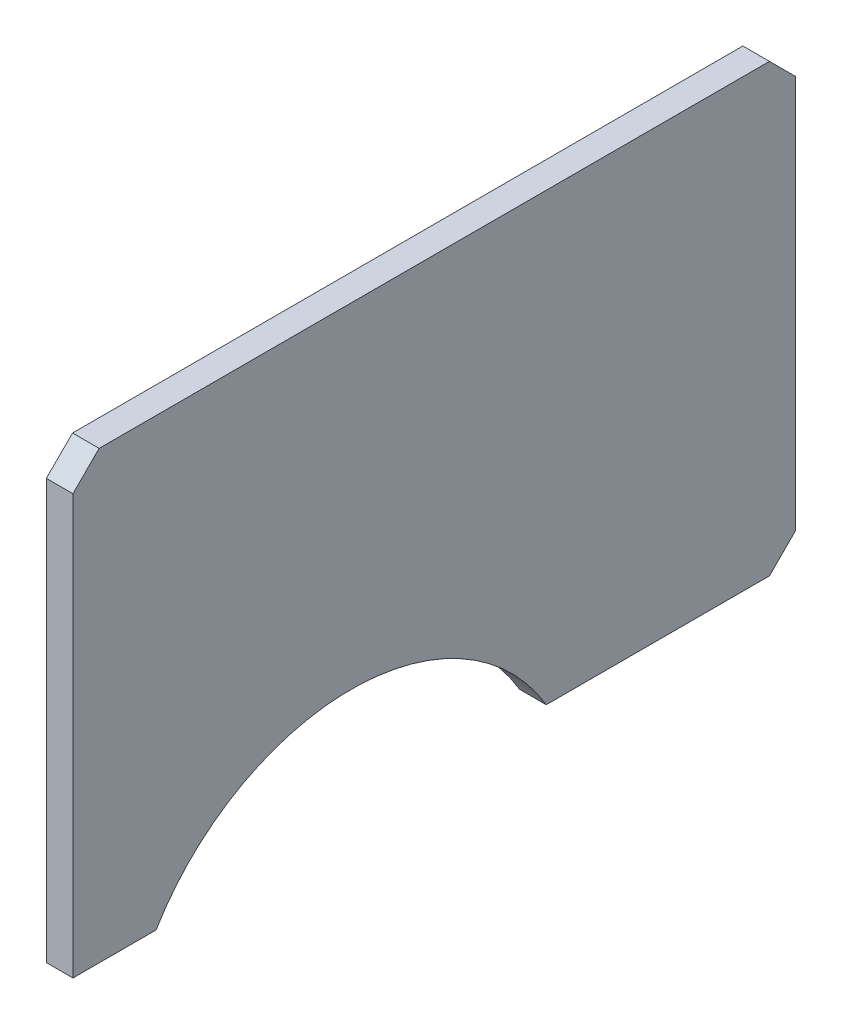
ISO-10303-21;
HEADER;
FILE_DESCRIPTION(('STEP AP214'),'2;1');
FILE_NAME('part.step','',(''),(''),'','','');
FILE_SCHEMA(('AUTOMOTIVE_DESIGN { 1 0 10303 214 1 1 1 1 }'));
ENDSEC;
DATA;
#1=APPLICATION_CONTEXT('core data for automotive mechanical design processes');
#2=APPLICATION_PROTOCOL_DEFINITION('international standard','automotive_design',2000,#1);
#3=PRODUCT_CONTEXT('',#1,'mechanical');
#4=PRODUCT('Part','Part','',(#3));
#5=PRODUCT_RELATED_PRODUCT_CATEGORY('part','',(#4));
#6=PRODUCT_DEFINITION_FORMATION('','',#4);
#7=PRODUCT_DEFINITION_CONTEXT('part definition',#1,'design');
#8=PRODUCT_DEFINITION('design','',#6,#7);
#9=PRODUCT_DEFINITION_SHAPE('','',#8);
#10=(LENGTH_UNIT() NAMED_UNIT(*) SI_UNIT(.MILLI.,.METRE.));
#11=(NAMED_UNIT(*) PLANE_ANGLE_UNIT() SI_UNIT($,.RADIAN.));
#12=(NAMED_UNIT(*) SI_UNIT($,.STERADIAN.) SOLID_ANGLE_UNIT());
#13=UNCERTAINTY_MEASURE_WITH_UNIT(LENGTH_MEASURE(1.E-05),#10,'distance_accuracy_value','');
#14=(GEOMETRIC_REPRESENTATION_CONTEXT(3) GLOBAL_UNCERTAINTY_ASSIGNED_CONTEXT((#13)) GLOBAL_UNIT_ASSIGNED_CONTEXT((#10,
#11,#12)) REPRESENTATION_CONTEXT('',''));
#15=CARTESIAN_POINT('',(0.,0.,0.));
#16=DIRECTION('',(0.,0.,1.));
#17=DIRECTION('',(1.,0.,0.));
#18=AXIS2_PLACEMENT_3D('',#15,#16,#17);
#19=CARTESIAN_POINT('',(384.979205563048,181.6432469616,-296.936999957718));
#20=DIRECTION('',(0.,-1.,0.));
#21=DIRECTION('',(0.,0.,-1.));
#22=AXIS2_PLACEMENT_3D('',#19,#20,#21);
#23=PLANE('',#22);
#24=DIRECTION('',(1.,0.,0.));
#25=VECTOR('',#24,1.);
#26=CARTESIAN_POINT('',(384.979205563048,181.6432469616,-269.361999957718));
#27=LINE('',#26,#25);
#28=CARTESIAN_POINT('',(384.979205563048,181.6432469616,-269.361999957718));
#29=VERTEX_POINT('',#28);
#30=CARTESIAN_POINT('',(388.027205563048,181.6432469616,-269.361999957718));
#31=VERTEX_POINT('',#30);
#32=EDGE_CURVE('E50',#29,#31,#27,.T.);
#33=ORIENTED_EDGE('',*,*,#32,.F.);
#34=DIRECTION('',(0.,0.,-1.));
#35=VECTOR('',#34,1.);
#36=CARTESIAN_POINT('',(384.979205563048,181.6432469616,-296.936999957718));
#37=LINE('',#36,#35);
#38=CARTESIAN_POINT('',(384.979205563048,181.6432469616,-294.936999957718));
#39=VERTEX_POINT('',#38);
#40=EDGE_CURVE('E120',#29,#39,#37,.T.);
#41=ORIENTED_EDGE('',*,*,#40,.T.);
#42=DIRECTION('',(1.,0.,0.));
#43=VECTOR('',#42,1.);
#44=CARTESIAN_POINT('',(384.979205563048,181.6432469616,-294.936999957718));
#45=LINE('',#44,#43);
#46=CARTESIAN_POINT('',(388.027205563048,181.6432469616,-294.936999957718));
#47=VERTEX_POINT('',#46);
#48=EDGE_CURVE('E133',#39,#47,#45,.T.);
#49=ORIENTED_EDGE('',*,*,#48,.T.);
#50=DIRECTION('',(0.,0.,-1.));
#51=VECTOR('',#50,1.);
#52=CARTESIAN_POINT('',(388.027205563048,181.6432469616,-296.936999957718));
#53=LINE('',#52,#51);
#54=EDGE_CURVE('E136',#31,#47,#53,.T.);
#55=ORIENTED_EDGE('',*,*,#54,.F.);
#56=EDGE_LOOP('',(#33,#41,#49,#55));
#57=FACE_BOUND('',#56,.T.);
#58=ADVANCED_FACE('F35',(#57),#23,.T.);
#59=DIRECTION('',(1.,0.,0.));
#60=VECTOR('',#59,1.);
#61=CARTESIAN_POINT('',(384.979205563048,181.6432469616,-224.657999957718));
#62=LINE('',#61,#60);
#63=CARTESIAN_POINT('',(384.979205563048,181.6432469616,-224.657999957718));
#64=VERTEX_POINT('',#63);
#65=CARTESIAN_POINT('',(388.027205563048,181.6432469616,-224.657999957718));
#66=VERTEX_POINT('',#65);
#67=EDGE_CURVE('E104',#64,#66,#62,.T.);
#68=ORIENTED_EDGE('',*,*,#67,.T.);
#69=CARTESIAN_POINT('',(388.027205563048,181.6432469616,-215.132999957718));
#70=VERTEX_POINT('',#69);
#71=EDGE_CURVE('E137',#70,#66,#53,.T.);
#72=ORIENTED_EDGE('',*,*,#71,.F.);
#73=DIRECTION('',(1.,0.,0.));
#74=VECTOR('',#73,1.);
#75=CARTESIAN_POINT('',(384.979205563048,181.6432469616,-215.132999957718));
#76=LINE('',#75,#74);
#77=CARTESIAN_POINT('',(384.979205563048,181.6432469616,-215.132999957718));
#78=VERTEX_POINT('',#77);
#79=EDGE_CURVE('E11',#78,#70,#76,.T.);
#80=ORIENTED_EDGE('',*,*,#79,.F.);
#81=EDGE_CURVE('E43',#78,#64,#37,.T.);
#82=ORIENTED_EDGE('',*,*,#81,.T.);
#83=EDGE_LOOP('',(#68,#72,#80,#82));
#84=FACE_BOUND('',#83,.T.);
#85=ADVANCED_FACE('F123',(#84),#23,.T.);
#86=CARTESIAN_POINT('',(384.979205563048,181.6432469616,-215.132999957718));
#87=DIRECTION('',(0.,0.,1.));
#88=DIRECTION('',(1.,0.,0.));
#89=AXIS2_PLACEMENT_3D('',#86,#87,#88);
#90=PLANE('',#89);
#91=DIRECTION('',(1.,0.,0.));
#92=VECTOR('',#91,1.);
#93=CARTESIAN_POINT('',(384.979205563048,229.6972469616,-215.132999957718));
#94=LINE('',#93,#92);
#95=CARTESIAN_POINT('',(384.979205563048,229.6972469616,-215.132999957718));
#96=VERTEX_POINT('',#95);
#97=CARTESIAN_POINT('',(388.027205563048,229.6972469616,-215.132999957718));
#98=VERTEX_POINT('',#97);
#99=EDGE_CURVE('E170',#96,#98,#94,.T.);
#100=ORIENTED_EDGE('',*,*,#99,.F.);
#101=DIRECTION('',(0.,-1.,0.));
#102=VECTOR('',#101,1.);
#103=CARTESIAN_POINT('',(384.979205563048,181.6432469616,-215.132999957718));
#104=LINE('',#103,#102);
#105=EDGE_CURVE('E125',#96,#78,#104,.T.);
#106=ORIENTED_EDGE('',*,*,#105,.T.);
#107=ORIENTED_EDGE('',*,*,#79,.T.);
#108=DIRECTION('',(0.,-1.,0.));
#109=VECTOR('',#108,1.);
#110=CARTESIAN_POINT('',(388.027205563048,181.6432469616,-215.132999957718));
#111=LINE('',#110,#109);
#112=EDGE_CURVE('E135',#98,#70,#111,.T.);
#113=ORIENTED_EDGE('',*,*,#112,.F.);
#114=EDGE_LOOP('',(#100,#106,#107,#113));
#115=FACE_BOUND('',#114,.T.);
#116=ADVANCED_FACE('F168',(#115),#90,.T.);
#117=CARTESIAN_POINT('',(384.979205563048,232.6972469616,-216.132999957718));
#118=DIRECTION('',(0.,1.,0.));
#119=DIRECTION('',(0.,0.,1.));
#120=AXIS2_PLACEMENT_3D('',#117,#118,#119);
#121=PLANE('',#120);
#122=DIRECTION('',(1.,0.,0.));
#123=VECTOR('',#122,1.);
#124=CARTESIAN_POINT('',(384.979205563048,232.6972469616,-294.936999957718));
#125=LINE('',#124,#123);
#126=CARTESIAN_POINT('',(384.979205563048,232.6972469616,-294.936999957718));
#127=VERTEX_POINT('',#126);
#128=CARTESIAN_POINT('',(388.027205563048,232.6972469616,-294.936999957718));
#129=VERTEX_POINT('',#128);
#130=EDGE_CURVE('E58',#127,#129,#125,.T.);
#131=ORIENTED_EDGE('',*,*,#130,.F.);
#132=DIRECTION('',(0.,0.,1.));
#133=VECTOR('',#132,1.);
#134=CARTESIAN_POINT('',(384.979205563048,232.6972469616,-216.132999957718));
#135=LINE('',#134,#133);
#136=CARTESIAN_POINT('',(384.979205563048,232.6972469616,-218.132999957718));
#137=VERTEX_POINT('',#136);
#138=EDGE_CURVE('E141',#127,#137,#135,.T.);
#139=ORIENTED_EDGE('',*,*,#138,.T.);
#140=DIRECTION('',(1.,0.,0.));
#141=VECTOR('',#140,1.);
#142=CARTESIAN_POINT('',(384.979205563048,232.6972469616,-218.132999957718));
#143=LINE('',#142,#141);
#144=CARTESIAN_POINT('',(388.027205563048,232.6972469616,-218.132999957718));
#145=VERTEX_POINT('',#144);
#146=EDGE_CURVE('E157',#137,#145,#143,.T.);
#147=ORIENTED_EDGE('',*,*,#146,.T.);
#148=DIRECTION('',(0.,0.,1.));
#149=VECTOR('',#148,1.);
#150=CARTESIAN_POINT('',(388.027205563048,232.6972469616,-216.132999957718));
#151=LINE('',#150,#149);
#152=EDGE_CURVE('E132',#129,#145,#151,.T.);
#153=ORIENTED_EDGE('',*,*,#152,.F.);
#154=EDGE_LOOP('',(#131,#139,#147,#153));
#155=FACE_BOUND('',#154,.T.);
#156=ADVANCED_FACE('F192',(#155),#121,.T.);
#157=CARTESIAN_POINT('',(384.979205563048,231.6972469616,-297.936999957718));
#158=DIRECTION('',(0.,0.,-1.));
#159=DIRECTION('',(-1.,0.,0.));
#160=AXIS2_PLACEMENT_3D('',#157,#158,#159);
#161=PLANE('',#160);
#162=DIRECTION('',(1.,0.,0.));
#163=VECTOR('',#162,1.);
#164=CARTESIAN_POINT('',(384.979205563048,229.6972469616,-297.936999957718));
#165=LINE('',#164,#163);
#166=CARTESIAN_POINT('',(384.979205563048,229.6972469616,-297.936999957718));
#167=VERTEX_POINT('',#166);
#168=CARTESIAN_POINT('',(388.027205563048,229.6972469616,-297.936999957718));
#169=VERTEX_POINT('',#168);
#170=EDGE_CURVE('E179',#167,#169,#165,.T.);
#171=ORIENTED_EDGE('',*,*,#170,.T.);
#172=DIRECTION('',(0.,1.,0.));
#173=VECTOR('',#172,1.);
#174=CARTESIAN_POINT('',(388.027205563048,231.6972469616,-297.936999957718));
#175=LINE('',#174,#173);
#176=CARTESIAN_POINT('',(388.027205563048,184.6432469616,-297.936999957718));
#177=VERTEX_POINT('',#176);
#178=EDGE_CURVE('E129',#177,#169,#175,.T.);
#179=ORIENTED_EDGE('',*,*,#178,.F.);
#180=DIRECTION('',(1.,0.,0.));
#181=VECTOR('',#180,1.);
#182=CARTESIAN_POINT('',(384.979205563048,184.6432469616,-297.936999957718));
#183=LINE('',#182,#181);
#184=CARTESIAN_POINT('',(384.979205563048,184.6432469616,-297.936999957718));
#185=VERTEX_POINT('',#184);
#186=EDGE_CURVE('E155',#185,#177,#183,.T.);
#187=ORIENTED_EDGE('',*,*,#186,.F.);
#188=DIRECTION('',(0.,1.,0.));
#189=VECTOR('',#188,1.);
#190=CARTESIAN_POINT('',(384.979205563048,231.6972469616,-297.936999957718));
#191=LINE('',#190,#189);
#192=EDGE_CURVE('E138',#185,#167,#191,.T.);
#193=ORIENTED_EDGE('',*,*,#192,.T.);
#194=EDGE_LOOP('',(#171,#179,#187,#193));
#195=FACE_BOUND('',#194,.T.);
#196=ADVANCED_FACE('F37',(#195),#161,.T.);
#197=CARTESIAN_POINT('',(384.979205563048,182.6432469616,-296.936999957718));
#198=DIRECTION('',(1.,0.,0.));
#199=DIRECTION('',(0.,0.,-1.));
#200=AXIS2_PLACEMENT_3D('',#197,#198,#199);
#201=PLANE('',#200);
#202=ORIENTED_EDGE('',*,*,#40,.F.);
#203=CARTESIAN_POINT('',(384.979205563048,168.3234869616,-247.009999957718));
#204=DIRECTION('',(1.,0.,0.));
#205=DIRECTION('',(0.,0.,1.));
#206=AXIS2_PLACEMENT_3D('',#203,#204,#205);
#207=CIRCLE('',#206,26.01976);
#208=EDGE_CURVE('E107',#29,#64,#207,.T.);
#209=ORIENTED_EDGE('',*,*,#208,.T.);
#210=ORIENTED_EDGE('',*,*,#81,.F.);
#211=ORIENTED_EDGE('',*,*,#105,.F.);
#212=DIRECTION('',(0.,0.707106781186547,-0.707106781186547));
#213=VECTOR('',#212,1.);
#214=CARTESIAN_POINT('',(384.979205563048,229.6972469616,-215.132999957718));
#215=LINE('',#214,#213);
#216=EDGE_CURVE('E172',#96,#137,#215,.T.);
#217=ORIENTED_EDGE('',*,*,#216,.T.);
#218=ORIENTED_EDGE('',*,*,#138,.F.);
#219=DIRECTION('',(0.,-0.707106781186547,-0.707106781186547));
#220=VECTOR('',#219,1.);
#221=CARTESIAN_POINT('',(384.979205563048,232.6972469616,-294.936999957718));
#222=LINE('',#221,#220);
#223=EDGE_CURVE('E190',#127,#167,#222,.T.);
#224=ORIENTED_EDGE('',*,*,#223,.T.);
#225=ORIENTED_EDGE('',*,*,#192,.F.);
#226=DIRECTION('',(0.,-0.707106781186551,0.707106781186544));
#227=VECTOR('',#226,1.);
#228=CARTESIAN_POINT('',(384.979205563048,181.6432469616,-294.936999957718));
#229=LINE('',#228,#227);
#230=EDGE_CURVE('E156',#185,#39,#229,.T.);
#231=ORIENTED_EDGE('',*,*,#230,.T.);
#232=EDGE_LOOP('',(#202,#209,#210,#211,#217,#218,#224,#225,#231));
#233=FACE_BOUND('',#232,.T.);
#234=ADVANCED_FACE('F117',(#233),#201,.F.);
#235=CARTESIAN_POINT('',(388.027205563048,182.6432469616,-296.936999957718));
#236=DIRECTION('',(1.,0.,0.));
#237=DIRECTION('',(0.,0.,-1.));
#238=AXIS2_PLACEMENT_3D('',#235,#236,#237);
#239=PLANE('',#238);
#240=CARTESIAN_POINT('',(388.027205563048,168.3234869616,-247.009999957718));
#241=DIRECTION('',(1.,0.,0.));
#242=DIRECTION('',(0.,0.,1.));
#243=AXIS2_PLACEMENT_3D('',#240,#241,#242);
#244=CIRCLE('',#243,26.01976);
#245=EDGE_CURVE('E108',#31,#66,#244,.T.);
#246=ORIENTED_EDGE('',*,*,#245,.F.);
#247=ORIENTED_EDGE('',*,*,#54,.T.);
#248=DIRECTION('',(0.,-0.707106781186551,0.707106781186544));
#249=VECTOR('',#248,1.);
#250=CARTESIAN_POINT('',(388.027205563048,181.6432469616,-294.936999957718));
#251=LINE('',#250,#249);
#252=EDGE_CURVE('E147',#177,#47,#251,.T.);
#253=ORIENTED_EDGE('',*,*,#252,.F.);
#254=ORIENTED_EDGE('',*,*,#178,.T.);
#255=DIRECTION('',(0.,-0.707106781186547,-0.707106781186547));
#256=VECTOR('',#255,1.);
#257=CARTESIAN_POINT('',(388.027205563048,232.6972469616,-294.936999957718));
#258=LINE('',#257,#256);
#259=EDGE_CURVE('E187',#129,#169,#258,.T.);
#260=ORIENTED_EDGE('',*,*,#259,.F.);
#261=ORIENTED_EDGE('',*,*,#152,.T.);
#262=DIRECTION('',(0.,0.707106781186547,-0.707106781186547));
#263=VECTOR('',#262,1.);
#264=CARTESIAN_POINT('',(388.027205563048,229.6972469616,-215.132999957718));
#265=LINE('',#264,#263);
#266=EDGE_CURVE('E175',#98,#145,#265,.T.);
#267=ORIENTED_EDGE('',*,*,#266,.F.);
#268=ORIENTED_EDGE('',*,*,#112,.T.);
#269=ORIENTED_EDGE('',*,*,#71,.T.);
#270=EDGE_LOOP('',(#246,#247,#253,#254,#260,#261,#267,#268,#269));
#271=FACE_BOUND('',#270,.T.);
#272=ADVANCED_FACE('F146',(#271),#239,.T.);
#273=CARTESIAN_POINT('',(384.979205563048,181.6432469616,-294.936999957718));
#274=DIRECTION('',(0.,0.707106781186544,0.707106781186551));
#275=DIRECTION('',(0.,-0.707106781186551,0.707106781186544));
#276=AXIS2_PLACEMENT_3D('',#273,#274,#275);
#277=PLANE('',#276);
#278=ORIENTED_EDGE('',*,*,#252,.T.);
#279=ORIENTED_EDGE('',*,*,#48,.F.);
#280=ORIENTED_EDGE('',*,*,#230,.F.);
#281=ORIENTED_EDGE('',*,*,#186,.T.);
#282=EDGE_LOOP('',(#278,#279,#280,#281));
#283=FACE_BOUND('',#282,.T.);
#284=ADVANCED_FACE('F153',(#283),#277,.F.);
#285=CARTESIAN_POINT('',(384.979205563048,229.6972469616,-215.132999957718));
#286=DIRECTION('',(0.,-0.707106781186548,-0.707106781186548));
#287=DIRECTION('',(0.,0.707106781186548,-0.707106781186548));
#288=AXIS2_PLACEMENT_3D('',#285,#286,#287);
#289=PLANE('',#288);
#290=ORIENTED_EDGE('',*,*,#266,.T.);
#291=ORIENTED_EDGE('',*,*,#146,.F.);
#292=ORIENTED_EDGE('',*,*,#216,.F.);
#293=ORIENTED_EDGE('',*,*,#99,.T.);
#294=EDGE_LOOP('',(#290,#291,#292,#293));
#295=FACE_BOUND('',#294,.T.);
#296=ADVANCED_FACE('F193',(#295),#289,.F.);
#297=CARTESIAN_POINT('',(384.979205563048,232.6972469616,-294.936999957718));
#298=DIRECTION('',(0.,-0.707106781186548,0.707106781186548));
#299=DIRECTION('',(0.,-0.707106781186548,-0.707106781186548));
#300=AXIS2_PLACEMENT_3D('',#297,#298,#299);
#301=PLANE('',#300);
#302=ORIENTED_EDGE('',*,*,#259,.T.);
#303=ORIENTED_EDGE('',*,*,#170,.F.);
#304=ORIENTED_EDGE('',*,*,#223,.F.);
#305=ORIENTED_EDGE('',*,*,#130,.T.);
#306=EDGE_LOOP('',(#302,#303,#304,#305));
#307=FACE_BOUND('',#306,.T.);
#308=ADVANCED_FACE('F195',(#307),#301,.F.);
#309=CARTESIAN_POINT('',(384.979205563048,168.3234869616,-247.009999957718));
#310=DIRECTION('',(1.,0.,0.));
#311=DIRECTION('',(0.,0.,-1.));
#312=AXIS2_PLACEMENT_3D('',#309,#310,#311);
#313=CYLINDRICAL_SURFACE('',#312,26.01976);
#314=ORIENTED_EDGE('',*,*,#245,.T.);
#315=ORIENTED_EDGE('',*,*,#67,.F.);
#316=ORIENTED_EDGE('',*,*,#208,.F.);
#317=ORIENTED_EDGE('',*,*,#32,.T.);
#318=EDGE_LOOP('',(#314,#315,#316,#317));
#319=FACE_BOUND('',#318,.T.);
#320=ADVANCED_FACE('F106',(#319),#313,.F.);
#321=CLOSED_SHELL('',(#58,#85,#116,#156,#196,#234,#272,#284,#296,#308,#320));
#322=MANIFOLD_SOLID_BREP('B2',#321);
#323=ADVANCED_BREP_SHAPE_REPRESENTATION('',(#18,#322),#14);
#324=SHAPE_DEFINITION_REPRESENTATION(#9,#323);
ENDSEC;
END-ISO-10303-21;
